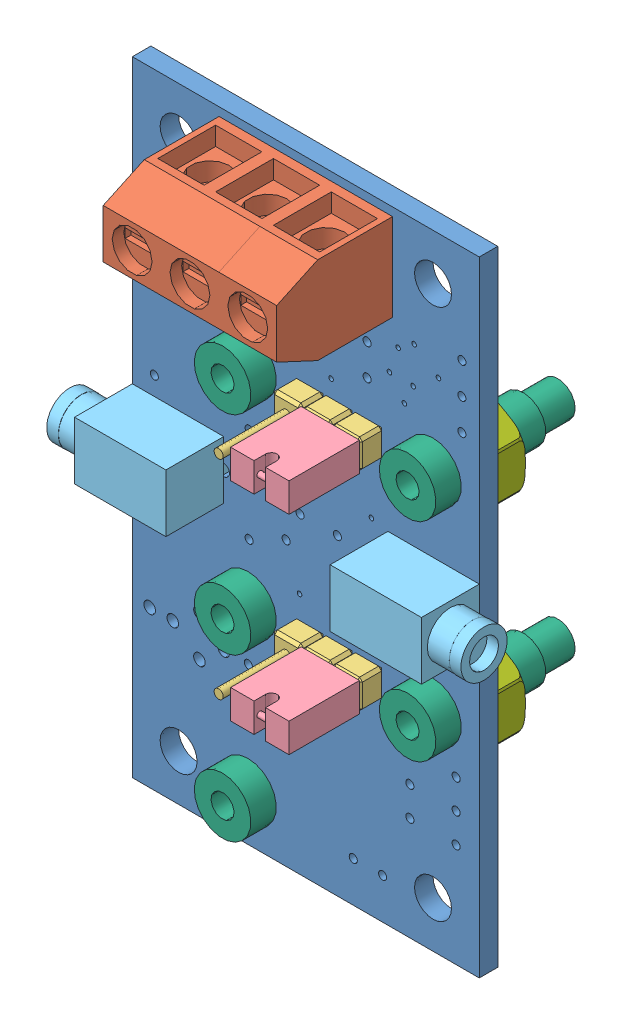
SolidWorks assembly Module K-AP-MMAV pour fiches.SLDASM, configuration Défaut (file format 5000). Lengths in mm.
Overall size (35.82 54 20.82).
24 component instances, 7 part files, 35 mates.
Components (placement in the parent):
- CI AP-LOG-1: CI AP-LOG.SLDPRT [Défaut] at (-19.3466 -28.0187 -0.8) size (30 54 1.6)
- BORNIER 3-1: BORNIER 3.SLDPRT [Default] at (3.1534 25.2558 0.8) x (-1 0 0) z (0 0 1) size (15 7.55 15.02)
- ASB 3PICOTS avec capuchon-1: ASB 3PICOTS avec capuchon.SLDASM [Default] at (-3.7407 -9.3519 4.903) x (-1 0 0) z (0 0 -1) size (7.59 2.51 10.25)
  - PICOT-1: PICOT.SLDPRT [Default] at (26.8516 -23.7306 1.953) size (2.51 2.51 10)
  - PICOT-2: PICOT.SLDPRT [Default] at (29.3916 -23.7306 1.953) size (2.51 2.51 10)
  - PICOT-3: PICOT.SLDPRT [Default] at (24.3116 -23.7306 1.953) size (2.51 2.51 10)
  - Capuchon picot-1: Capuchon picot.SLDPRT [Défaut] at (-6.1888 -1.9209 1.953) size (5.05 2.51 6.1)
- ASB 3PICOTS avec capuchon-2: ASB 3PICOTS avec capuchon.SLDASM [Default] at (-3.7407 8.6466 4.903) x (-1 0 0) z (0 0 -1) size (7.59 2.51 10.25)
  - PICOT-1: PICOT.SLDPRT [Default] at (26.8516 -23.7306 1.953) size (2.51 2.51 10)
  - PICOT-2: PICOT.SLDPRT [Default] at (29.3916 -23.7306 1.953) size (2.51 2.51 10)
  - PICOT-3: PICOT.SLDPRT [Default] at (24.3116 -23.7306 1.953) size (2.51 2.51 10)
  - Capuchon picot-1: Capuchon picot.SLDPRT [Défaut] at (-6.1888 -1.9209 1.953) size (5.05 2.51 6.1)
- Embase jack 2.5-1: Embase jack 2.5.SLDPRT [Défaut] at (-19.3472 -1.0185 0.8) x (1 0 0) z (0 -1 0) size (10.81 8.01 5)
- Embase jack 2.5-2: Embase jack 2.5.SLDPRT [Défaut] at (10.6548 -1.0185 0.8) x (-1 0 0) z (0 1 0) size (10.81 8.01 5)
- Connecteur banane-1: Connecteur banane.SLDPRT [Défaut] at (6.6529 -10.0177 -10) x (-0.719568 -0.694422 0) z (-0.694422 0.719568 0) size (4.9 13 4.9)
- Ecrou M4-1: Ecrou M4.SLDPRT [Défaut] at (-9.3466 -24.0182 -3.8) size (6.84 7.97 3.43)
- Ecrou M4-2: Ecrou M4.SLDPRT [Défaut] at (-9.3466 -10.0177 -3.8) size (6.84 7.97 3.43)
- Ecrou M4-3: Ecrou M4.SLDPRT [Défaut] at (6.6529 -10.0177 -3.8) size (6.84 7.97 3.43)
- Ecrou M4-4: Ecrou M4.SLDPRT [Défaut] at (-9.3466 7.9807 -3.8) size (6.84 7.97 3.43)
- Ecrou M4-5: Ecrou M4.SLDPRT [Défaut] at (6.6529 7.9807 -3.8) size (6.84 7.97 3.43)
- Connecteur banane-2: Connecteur banane.SLDPRT [Défaut] at (-9.3466 -10.0177 -10) x (-0.719568 -0.694422 0) z (-0.694422 0.719568 0) size (4.9 13 4.9)
- Connecteur banane-3: Connecteur banane.SLDPRT [Défaut] at (-9.3466 7.9807 -10) x (-0.719568 -0.694422 0) z (-0.694422 0.719568 0) size (4.9 13 4.9)
- Connecteur banane-4: Connecteur banane.SLDPRT [Défaut] at (6.6529 7.9807 -10) x (-0.719568 -0.694422 0) z (-0.694422 0.719568 0) size (4.9 13 4.9)
- Connecteur banane-5: Connecteur banane.SLDPRT [Défaut] at (-9.3466 -24.0182 -10) x (-0.719568 -0.694422 0) z (-0.694422 0.719568 0) size (4.9 13 4.9)
Mates (geometry in assembly coordinates):
- Coïncidente1: coincident anti-aligned: axis of CI AP-LOG-1 through (0.6534 21.4808 0.8) axis (0 0 -1); axis of BORNIER 3-1 through (0.6534 21.4808 -3.7) axis (0 0 1)
- Coïncidente2: coincident anti-aligned: axis of CI AP-LOG-1 through (-9.3466 21.4808 0.8) axis (0 0 -1); axis of BORNIER 3-1 through (-9.3466 21.4808 -3.7) axis (0 0 1)
- Coïncidente3: coincident anti-aligned: plane of CI AP-LOG-1 through (-19.3466 -28.0187 0.8) normal (0 0 1); plane of BORNIER 3-1 through (3.1534 25.2558 0.8) normal (0 0 -1)
- Coïncidente4: coincident anti-aligned: axis of CI AP-LOG-1 through (1.1931 -10.0177 0.8) axis (0 0 -1); axis of ASB 3PICOTS avec capuchon-1/PICOT-3 through (1.1931 -10.0177 -1.2) axis (0 0 1)
- Coïncidente5: coincident anti-aligned: axis of CI AP-LOG-1 through (-3.8869 -10.0177 0.8) axis (0 0 -1); axis of ASB 3PICOTS avec capuchon-1/PICOT-2 through (-3.8869 -10.0177 -1.2) axis (0 0 1)
- Coïncidente6: coincident anti-aligned: plane of CI AP-LOG-1 through (-19.3466 -28.0187 0.8) normal (0 0 1); plane of ASB 3PICOTS avec capuchon-1/PICOT-1 through (-0.0919 -11.2727 0.8) normal (0 0 -1)
- Coïncidente7: coincident anti-aligned: axis of CI AP-LOG-1 through (1.1931 7.9807 0.8) axis (0 0 -1); axis of ASB 3PICOTS avec capuchon-2/PICOT-3 through (1.1931 7.9807 -1.2) axis (0 0 1)
- Coïncidente8: coincident anti-aligned: axis of CI AP-LOG-1 through (-3.8869 7.9807 0.8) axis (0 0 -1); axis of ASB 3PICOTS avec capuchon-2/PICOT-2 through (-3.8869 7.9807 -1.2) axis (0 0 1)
- Coïncidente9: coincident anti-aligned: plane of CI AP-LOG-1 through (-19.3466 -28.0187 0.8) normal (0 0 1); plane of ASB 3PICOTS avec capuchon-2/PICOT-2 through (-2.6319 6.7257 0.8) normal (0 0 -1)
- Coïncidente10: coincident anti-aligned: axis of CI AP-LOG-1 through (-15.8472 -1.0185 0.8) axis (0 0 -1); axis of Embase jack 2.5-1 through (-15.8472 -1.0185 -1.2) axis (0 0 1)
- Parallèle1: parallel aligned: plane of CI AP-LOG-1 through (-19.3466 25.9813 0.8) normal (-1 0 0); plane of Embase jack 2.5-1 through (-19.3472 1.4815 5.8) normal (-1 0 0)
- Coïncidente12: coincident anti-aligned: plane of CI AP-LOG-1 through (-19.3466 -28.0187 0.8) normal (0 0 1); plane of Embase jack 2.5-1 through (-19.3472 -3.5185 0.8) normal (0 0 -1)
- Coïncidente13: coincident anti-aligned: axis of CI AP-LOG-1 through (7.1548 -1.0185 0.8) axis (0 0 -1); axis of Embase jack 2.5-2 through (7.1548 -1.0185 -1.2) axis (0 0 1)
- Parallèle2: parallel aligned: plane of CI AP-LOG-1 through (10.6534 25.9813 0.8) normal (1 0 0); plane of Embase jack 2.5-2 through (10.6548 -3.5185 5.8) normal (1 0 0)
- Coïncidente15: coincident anti-aligned: plane of CI AP-LOG-1 through (-19.3466 -28.0187 0.8) normal (0 0 1); plane of Embase jack 2.5-2 through (10.6548 1.4815 0.8) normal (0 0 -1)
- Coïncidente17: coincident aligned: axis of CI AP-LOG-1 through (-9.3466 -24.0182 0.8) axis (0 0 -1); axis of Connecteur banane-5 through (-9.3466 -24.0182 0.8) axis (0 0 -1)
- Coïncidente18: coincident anti-aligned: plane of CI AP-LOG-1 through (-19.3466 -28.0187 0.8) normal (0 0 1); circle of Connecteur banane-5
- Coïncidente19: coincident aligned: axis of CI AP-LOG-1 through (6.6529 -10.0177 0.8) axis (0 0 -1); axis of Connecteur banane-1 through (6.6529 -10.0177 0.8) axis (0 0 -1)
- Coïncidente20: coincident anti-aligned: plane of CI AP-LOG-1 through (-19.3466 -28.0187 0.8) normal (0 0 1); circle of Connecteur banane-1
- Coïncidente21: coincident aligned: axis of CI AP-LOG-1 through (-9.3466 -10.0177 0.8) axis (0 0 -1); axis of Connecteur banane-2 through (-9.3466 -10.0177 0.8) axis (0 0 -1)
- Coïncidente22: coincident anti-aligned: plane of CI AP-LOG-1 through (-19.3466 -28.0187 0.8) normal (0 0 1); circle of Connecteur banane-2
- Coïncidente23: coincident aligned: axis of CI AP-LOG-1 through (6.6529 7.9807 0.8) axis (0 0 -1); axis of Connecteur banane-4 through (6.6529 7.9807 0.8) axis (0 0 -1)
- Coïncidente24: coincident anti-aligned: plane of CI AP-LOG-1 through (-19.3466 -28.0187 0.8) normal (0 0 1); circle of Connecteur banane-4
- Coïncidente25: coincident aligned: axis of CI AP-LOG-1 through (-9.3466 7.9807 0.8) axis (0 0 -1); axis of Connecteur banane-3 through (-9.3466 7.9807 0.8) axis (0 0 -1)
- Coïncidente26: coincident anti-aligned: plane of CI AP-LOG-1 through (-19.3466 -28.0187 0.8) normal (0 0 1); circle of Connecteur banane-3
- Coïncidente27: coincident aligned: axis of Ecrou M4-1 through (-9.3466 -24.0182 -1.3) axis (0 0 -1); axis of Connecteur banane-5 through (-9.3466 -24.0182 0.8) axis (0 0 -1)
- Coïncidente28: coincident aligned: axis of Ecrou M4-2 through (-9.3466 -10.0177 -1.3) axis (0 0 -1); axis of Connecteur banane-2 through (-9.3466 -10.0177 0.8) axis (0 0 -1)
- Coïncidente29: coincident aligned: axis of Connecteur banane-1 through (6.6529 -10.0177 0.8) axis (0 0 -1); axis of Ecrou M4-3 through (6.6529 -10.0177 -1.3) axis (0 0 -1)
- Coïncidente30: coincident aligned: axis of Ecrou M4-5 through (6.6529 7.9807 -1.3) axis (0 0 -1); axis of Connecteur banane-4 through (6.6529 7.9807 0.8) axis (0 0 -1)
- Coïncidente31: coincident aligned: axis of Ecrou M4-4 through (-9.3466 7.9807 -1.3) axis (0 0 -1); axis of Connecteur banane-3 through (-9.3466 7.9807 0.8) axis (0 0 -1)
- Coïncidente32: coincident anti-aligned: plane of CI AP-LOG-1 through (-19.3466 -28.0187 -0.8) normal (0 0 -1); plane of Ecrou M4-1 through (-9.3466 -24.0182 -0.8) normal (0 0 1)
- Coïncidente33: coincident anti-aligned: plane of CI AP-LOG-1 through (-19.3466 -28.0187 -0.8) normal (0 0 -1); plane of Ecrou M4-2 through (-9.3466 -10.0177 -0.8) normal (0 0 1)
- Coïncidente34: coincident anti-aligned: plane of CI AP-LOG-1 through (-19.3466 -28.0187 -0.8) normal (0 0 -1); plane of Ecrou M4-3 through (6.6529 -10.0177 -0.8) normal (0 0 1)
- Coïncidente35: coincident anti-aligned: plane of CI AP-LOG-1 through (-19.3466 -28.0187 -0.8) normal (0 0 -1); plane of Ecrou M4-5 through (6.6529 7.9807 -0.8) normal (0 0 1)
- Coïncidente36: coincident anti-aligned: plane of CI AP-LOG-1 through (-19.3466 -28.0187 -0.8) normal (0 0 -1); plane of Ecrou M4-4 through (-9.3466 7.9807 -0.8) normal (0 0 1)
